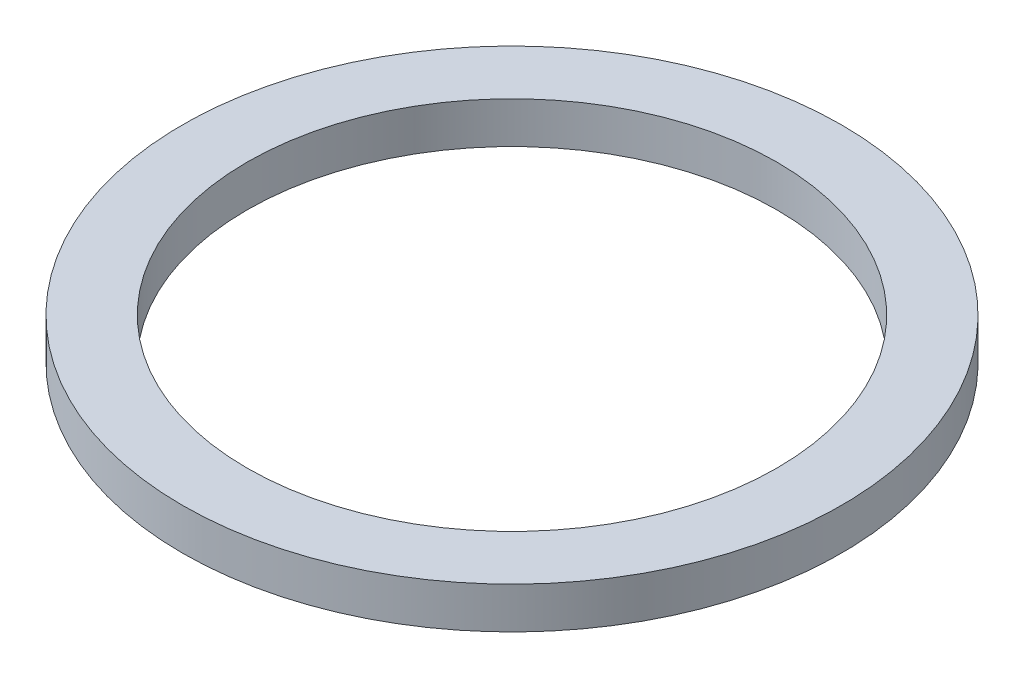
from build123d import *

# Parameters (mm, degrees)
SKETCH1_R           = 12.6365
SKETCH1_R_2         = 10.16
BOSS_EXTRUDE1_DEPTH = 1.5875


with BuildPart() as part:
    # Sketch1 → Boss-Extrude1 (new body)
    with BuildSketch(Plane(origin=(0, 0, 0), x_dir=(1, 0, 0), z_dir=(0, 1, 0))):
        with Locations(Location((0, 0, 0), (0, 0, 270))):
            Circle(SKETCH1_R)
        with Locations(Location((0, 0, 0), (0, 0, 270))):
            Circle(SKETCH1_R_2, mode=Mode.SUBTRACT)
    extrude(amount=BOSS_EXTRUDE1_DEPTH)


solid = part.part
